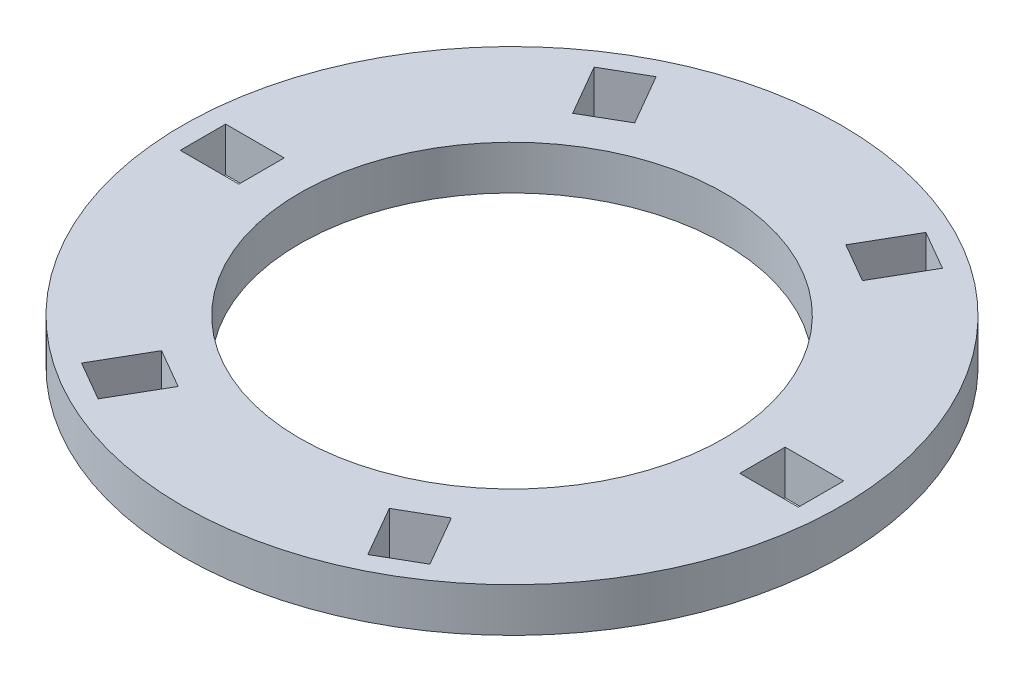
ISO-10303-21;
HEADER;
FILE_DESCRIPTION(('STEP AP214'),'2;1');
FILE_NAME('part.step','',(''),(''),'','','');
FILE_SCHEMA(('AUTOMOTIVE_DESIGN { 1 0 10303 214 1 1 1 1 }'));
ENDSEC;
DATA;
#1=APPLICATION_CONTEXT('core data for automotive mechanical design processes');
#2=APPLICATION_PROTOCOL_DEFINITION('international standard','automotive_design',2000,#1);
#3=PRODUCT_CONTEXT('',#1,'mechanical');
#4=PRODUCT('Part','Part','',(#3));
#5=PRODUCT_RELATED_PRODUCT_CATEGORY('part','',(#4));
#6=PRODUCT_DEFINITION_FORMATION('','',#4);
#7=PRODUCT_DEFINITION_CONTEXT('part definition',#1,'design');
#8=PRODUCT_DEFINITION('design','',#6,#7);
#9=PRODUCT_DEFINITION_SHAPE('','',#8);
#10=(LENGTH_UNIT() NAMED_UNIT(*) SI_UNIT(.MILLI.,.METRE.));
#11=(NAMED_UNIT(*) PLANE_ANGLE_UNIT() SI_UNIT($,.RADIAN.));
#12=(NAMED_UNIT(*) SI_UNIT($,.STERADIAN.) SOLID_ANGLE_UNIT());
#13=UNCERTAINTY_MEASURE_WITH_UNIT(LENGTH_MEASURE(1.E-05),#10,'distance_accuracy_value','');
#14=(GEOMETRIC_REPRESENTATION_CONTEXT(3) GLOBAL_UNCERTAINTY_ASSIGNED_CONTEXT((#13)) GLOBAL_UNIT_ASSIGNED_CONTEXT((#10,
#11,#12)) REPRESENTATION_CONTEXT('',''));
#15=CARTESIAN_POINT('',(0.,0.,0.));
#16=DIRECTION('',(0.,0.,1.));
#17=DIRECTION('',(1.,0.,0.));
#18=AXIS2_PLACEMENT_3D('',#15,#16,#17);
#19=CARTESIAN_POINT('',(0.,6.,0.));
#20=DIRECTION('',(0.,-1.,0.));
#21=DIRECTION('',(0.,0.,-1.));
#22=AXIS2_PLACEMENT_3D('',#19,#20,#21);
#23=CYLINDRICAL_SURFACE('',#22,45.);
#24=CARTESIAN_POINT('',(0.,6.,0.));
#25=DIRECTION('',(0.,1.,0.));
#26=DIRECTION('',(0.,0.,-1.));
#27=AXIS2_PLACEMENT_3D('',#24,#25,#26);
#28=CIRCLE('',#27,45.);
#29=CARTESIAN_POINT('',(0.,6.,-45.));
#30=VERTEX_POINT('',#29);
#31=EDGE_CURVE('E11',#30,#30,#28,.T.);
#32=ORIENTED_EDGE('',*,*,#31,.F.);
#33=EDGE_LOOP('',(#32));
#34=FACE_BOUND('',#33,.T.);
#35=CARTESIAN_POINT('',(0.,0.,0.));
#36=DIRECTION('',(0.,1.,0.));
#37=DIRECTION('',(0.,0.,-1.));
#38=AXIS2_PLACEMENT_3D('',#35,#36,#37);
#39=CIRCLE('',#38,45.);
#40=CARTESIAN_POINT('',(0.,0.,-45.));
#41=VERTEX_POINT('',#40);
#42=EDGE_CURVE('E44',#41,#41,#39,.T.);
#43=ORIENTED_EDGE('',*,*,#42,.T.);
#44=EDGE_LOOP('',(#43));
#45=FACE_BOUND('',#44,.T.);
#46=ADVANCED_FACE('F41',(#34,#45),#23,.T.);
#47=CARTESIAN_POINT('',(0.,6.,0.));
#48=DIRECTION('',(0.,-1.,0.));
#49=DIRECTION('',(0.,0.,-1.));
#50=AXIS2_PLACEMENT_3D('',#47,#48,#49);
#51=PLANE('',#50);
#52=DIRECTION('',(0.50000000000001,0.,0.866025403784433));
#53=VECTOR('',#52,1.);
#54=CARTESIAN_POINT('',(-23.7846787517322,6.,-34.996272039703));
#55=LINE('',#54,#53);
#56=CARTESIAN_POINT('',(-23.7846787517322,6.,-34.996272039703));
#57=VERTEX_POINT('',#56);
#58=CARTESIAN_POINT('',(-19.7846787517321,6.,-28.0680688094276));
#59=VERTEX_POINT('',#58);
#60=EDGE_CURVE('E323',#57,#59,#55,.T.);
#61=ORIENTED_EDGE('',*,*,#60,.F.);
#62=DIRECTION('',(-0.866025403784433,0.,0.50000000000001));
#63=VECTOR('',#62,1.);
#64=CARTESIAN_POINT('',(-18.4153212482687,6.,-38.0962720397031));
#65=LINE('',#64,#63);
#66=CARTESIAN_POINT('',(-18.4153212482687,6.,-38.0962720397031));
#67=VERTEX_POINT('',#66);
#68=EDGE_CURVE('E55',#67,#57,#65,.T.);
#69=ORIENTED_EDGE('',*,*,#68,.F.);
#70=DIRECTION('',(-0.50000000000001,0.,-0.866025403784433));
#71=VECTOR('',#70,1.);
#72=CARTESIAN_POINT('',(-18.4153212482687,6.,-38.0962720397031));
#73=LINE('',#72,#71);
#74=CARTESIAN_POINT('',(-14.4153212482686,6.,-31.1680688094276));
#75=VERTEX_POINT('',#74);
#76=EDGE_CURVE('E312',#75,#67,#73,.T.);
#77=ORIENTED_EDGE('',*,*,#76,.F.);
#78=DIRECTION('',(0.866025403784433,0.,-0.50000000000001));
#79=VECTOR('',#78,1.);
#80=CARTESIAN_POINT('',(-14.4153212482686,6.,-31.1680688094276));
#81=LINE('',#80,#79);
#82=EDGE_CURVE('E326',#59,#75,#81,.T.);
#83=ORIENTED_EDGE('',*,*,#82,.F.);
#84=EDGE_LOOP('',(#61,#69,#77,#83));
#85=FACE_BOUND('',#84,.T.);
#86=DIRECTION('',(-0.499999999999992,0.,0.866025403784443));
#87=VECTOR('',#86,1.);
#88=CARTESIAN_POINT('',(18.4153212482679,6.,-38.0962720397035));
#89=LINE('',#88,#87);
#90=CARTESIAN_POINT('',(18.4153212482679,6.,-38.0962720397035));
#91=VERTEX_POINT('',#90);
#92=CARTESIAN_POINT('',(14.4153212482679,6.,-31.1680688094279));
#93=VERTEX_POINT('',#92);
#94=EDGE_CURVE('E293',#91,#93,#89,.T.);
#95=ORIENTED_EDGE('',*,*,#94,.F.);
#96=DIRECTION('',(-0.866025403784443,0.,-0.499999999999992));
#97=VECTOR('',#96,1.);
#98=CARTESIAN_POINT('',(23.7846787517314,6.,-34.9962720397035));
#99=LINE('',#98,#97);
#100=CARTESIAN_POINT('',(23.7846787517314,6.,-34.9962720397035));
#101=VERTEX_POINT('',#100);
#102=EDGE_CURVE('E63',#101,#91,#99,.T.);
#103=ORIENTED_EDGE('',*,*,#102,.F.);
#104=DIRECTION('',(0.499999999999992,0.,-0.866025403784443));
#105=VECTOR('',#104,1.);
#106=CARTESIAN_POINT('',(23.7846787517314,6.,-34.9962720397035));
#107=LINE('',#106,#105);
#108=CARTESIAN_POINT('',(19.7846787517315,6.,-28.068068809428));
#109=VERTEX_POINT('',#108);
#110=EDGE_CURVE('E282',#109,#101,#107,.T.);
#111=ORIENTED_EDGE('',*,*,#110,.F.);
#112=DIRECTION('',(0.866025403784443,0.,0.499999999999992));
#113=VECTOR('',#112,1.);
#114=CARTESIAN_POINT('',(19.7846787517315,6.,-28.068068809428));
#115=LINE('',#114,#113);
#116=EDGE_CURVE('E297',#93,#109,#115,.T.);
#117=ORIENTED_EDGE('',*,*,#116,.F.);
#118=EDGE_LOOP('',(#95,#103,#111,#117));
#119=FACE_BOUND('',#118,.T.);
#120=DIRECTION('',(-1.,0.,0.));
#121=VECTOR('',#120,1.);
#122=CARTESIAN_POINT('',(42.2,6.,-3.1));
#123=LINE('',#122,#121);
#124=CARTESIAN_POINT('',(42.2,6.,-3.1));
#125=VERTEX_POINT('',#124);
#126=CARTESIAN_POINT('',(34.2,6.,-3.1));
#127=VERTEX_POINT('',#126);
#128=EDGE_CURVE('E262',#125,#127,#123,.T.);
#129=ORIENTED_EDGE('',*,*,#128,.F.);
#130=DIRECTION('',(0.,0.,-1.));
#131=VECTOR('',#130,1.);
#132=CARTESIAN_POINT('',(42.2,6.,3.09999999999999));
#133=LINE('',#132,#131);
#134=CARTESIAN_POINT('',(42.2,6.,3.09999999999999));
#135=VERTEX_POINT('',#134);
#136=EDGE_CURVE('E260',#135,#125,#133,.T.);
#137=ORIENTED_EDGE('',*,*,#136,.F.);
#138=DIRECTION('',(1.,0.,0.));
#139=VECTOR('',#138,1.);
#140=CARTESIAN_POINT('',(42.2,6.,3.09999999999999));
#141=LINE('',#140,#139);
#142=CARTESIAN_POINT('',(34.2,6.,3.1));
#143=VERTEX_POINT('',#142);
#144=EDGE_CURVE('E250',#143,#135,#141,.T.);
#145=ORIENTED_EDGE('',*,*,#144,.F.);
#146=DIRECTION('',(0.,0.,1.));
#147=VECTOR('',#146,1.);
#148=CARTESIAN_POINT('',(34.2,6.,3.1));
#149=LINE('',#148,#147);
#150=EDGE_CURVE('E266',#127,#143,#149,.T.);
#151=ORIENTED_EDGE('',*,*,#150,.F.);
#152=EDGE_LOOP('',(#129,#137,#145,#151));
#153=FACE_BOUND('',#152,.T.);
#154=DIRECTION('',(-0.500000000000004,0.,-0.866025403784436));
#155=VECTOR('',#154,1.);
#156=CARTESIAN_POINT('',(23.7846787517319,6.,34.9962720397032));
#157=LINE('',#156,#155);
#158=CARTESIAN_POINT('',(23.7846787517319,6.,34.9962720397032));
#159=VERTEX_POINT('',#158);
#160=CARTESIAN_POINT('',(19.7846787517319,6.,28.0680688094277));
#161=VERTEX_POINT('',#160);
#162=EDGE_CURVE('E235',#159,#161,#157,.T.);
#163=ORIENTED_EDGE('',*,*,#162,.F.);
#164=DIRECTION('',(0.866025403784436,0.,-0.500000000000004));
#165=VECTOR('',#164,1.);
#166=CARTESIAN_POINT('',(18.4153212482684,6.,38.0962720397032));
#167=LINE('',#166,#165);
#168=CARTESIAN_POINT('',(18.4153212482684,6.,38.0962720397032));
#169=VERTEX_POINT('',#168);
#170=EDGE_CURVE('E208',#169,#159,#167,.T.);
#171=ORIENTED_EDGE('',*,*,#170,.F.);
#172=DIRECTION('',(0.500000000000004,0.,0.866025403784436));
#173=VECTOR('',#172,1.);
#174=CARTESIAN_POINT('',(18.4153212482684,6.,38.0962720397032));
#175=LINE('',#174,#173);
#176=CARTESIAN_POINT('',(14.4153212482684,6.,31.1680688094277));
#177=VERTEX_POINT('',#176);
#178=EDGE_CURVE('E226',#177,#169,#175,.T.);
#179=ORIENTED_EDGE('',*,*,#178,.F.);
#180=DIRECTION('',(-0.866025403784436,0.,0.500000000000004));
#181=VECTOR('',#180,1.);
#182=CARTESIAN_POINT('',(14.4153212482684,6.,31.1680688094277));
#183=LINE('',#182,#181);
#184=EDGE_CURVE('E229',#161,#177,#183,.T.);
#185=ORIENTED_EDGE('',*,*,#184,.F.);
#186=EDGE_LOOP('',(#163,#171,#179,#185));
#187=FACE_BOUND('',#186,.T.);
#188=DIRECTION('',(0.499999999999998,0.,-0.86602540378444));
#189=VECTOR('',#188,1.);
#190=CARTESIAN_POINT('',(-18.4153212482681,6.,38.0962720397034));
#191=LINE('',#190,#189);
#192=CARTESIAN_POINT('',(-18.4153212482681,6.,38.0962720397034));
#193=VERTEX_POINT('',#192);
#194=CARTESIAN_POINT('',(-14.4153212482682,6.,31.1680688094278));
#195=VERTEX_POINT('',#194);
#196=EDGE_CURVE('E352',#193,#195,#191,.T.);
#197=ORIENTED_EDGE('',*,*,#196,.F.);
#198=DIRECTION('',(0.86602540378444,0.,0.499999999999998));
#199=VECTOR('',#198,1.);
#200=CARTESIAN_POINT('',(-23.7846787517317,6.,34.9962720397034));
#201=LINE('',#200,#199);
#202=CARTESIAN_POINT('',(-23.7846787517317,6.,34.9962720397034));
#203=VERTEX_POINT('',#202);
#204=EDGE_CURVE('E242',#203,#193,#201,.T.);
#205=ORIENTED_EDGE('',*,*,#204,.F.);
#206=DIRECTION('',(-0.499999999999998,0.,0.86602540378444));
#207=VECTOR('',#206,1.);
#208=CARTESIAN_POINT('',(-23.7846787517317,6.,34.9962720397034));
#209=LINE('',#208,#207);
#210=CARTESIAN_POINT('',(-19.7846787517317,6.,28.0680688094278));
#211=VERTEX_POINT('',#210);
#212=EDGE_CURVE('E341',#211,#203,#209,.T.);
#213=ORIENTED_EDGE('',*,*,#212,.F.);
#214=DIRECTION('',(-0.86602540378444,0.,-0.499999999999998));
#215=VECTOR('',#214,1.);
#216=CARTESIAN_POINT('',(-19.7846787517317,6.,28.0680688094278));
#217=LINE('',#216,#215);
#218=EDGE_CURVE('E355',#195,#211,#217,.T.);
#219=ORIENTED_EDGE('',*,*,#218,.F.);
#220=EDGE_LOOP('',(#197,#205,#213,#219));
#221=FACE_BOUND('',#220,.T.);
#222=DIRECTION('',(1.,0.,0.));
#223=VECTOR('',#222,1.);
#224=CARTESIAN_POINT('',(-42.2,6.,3.1));
#225=LINE('',#224,#223);
#226=CARTESIAN_POINT('',(-42.2,6.,3.1));
#227=VERTEX_POINT('',#226);
#228=CARTESIAN_POINT('',(-34.2,6.,3.1));
#229=VERTEX_POINT('',#228);
#230=EDGE_CURVE('E384',#227,#229,#225,.T.);
#231=ORIENTED_EDGE('',*,*,#230,.F.);
#232=DIRECTION('',(0.,0.,1.));
#233=VECTOR('',#232,1.);
#234=CARTESIAN_POINT('',(-42.2,6.,-3.09999999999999));
#235=LINE('',#234,#233);
#236=CARTESIAN_POINT('',(-42.2,6.,-3.09999999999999));
#237=VERTEX_POINT('',#236);
#238=EDGE_CURVE('E362',#237,#227,#235,.T.);
#239=ORIENTED_EDGE('',*,*,#238,.F.);
#240=DIRECTION('',(-1.,0.,0.));
#241=VECTOR('',#240,1.);
#242=CARTESIAN_POINT('',(-42.2,6.,-3.09999999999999));
#243=LINE('',#242,#241);
#244=CARTESIAN_POINT('',(-34.2,6.,-3.1));
#245=VERTEX_POINT('',#244);
#246=EDGE_CURVE('E373',#245,#237,#243,.T.);
#247=ORIENTED_EDGE('',*,*,#246,.F.);
#248=DIRECTION('',(0.,0.,-1.));
#249=VECTOR('',#248,1.);
#250=CARTESIAN_POINT('',(-34.2,6.,-3.1));
#251=LINE('',#250,#249);
#252=EDGE_CURVE('E387',#229,#245,#251,.T.);
#253=ORIENTED_EDGE('',*,*,#252,.F.);
#254=EDGE_LOOP('',(#231,#239,#247,#253));
#255=FACE_BOUND('',#254,.T.);
#256=CARTESIAN_POINT('',(0.,6.,0.));
#257=DIRECTION('',(0.,1.,0.));
#258=DIRECTION('',(0.,0.,1.));
#259=AXIS2_PLACEMENT_3D('',#256,#257,#258);
#260=CIRCLE('',#259,29.);
#261=CARTESIAN_POINT('',(0.,6.,29.));
#262=VERTEX_POINT('',#261);
#263=EDGE_CURVE('E394',#262,#262,#260,.T.);
#264=ORIENTED_EDGE('',*,*,#263,.F.);
#265=EDGE_LOOP('',(#264));
#266=FACE_BOUND('',#265,.T.);
#267=ORIENTED_EDGE('',*,*,#31,.T.);
#268=EDGE_LOOP('',(#267));
#269=FACE_BOUND('',#268,.T.);
#270=ADVANCED_FACE('F409',(#85,#119,#153,#187,#221,#255,#266,#269),#51,.F.);
#271=CARTESIAN_POINT('',(0.,0.,0.));
#272=DIRECTION('',(0.,-1.,0.));
#273=DIRECTION('',(0.,0.,-1.));
#274=AXIS2_PLACEMENT_3D('',#271,#272,#273);
#275=PLANE('',#274);
#276=DIRECTION('',(-0.866025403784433,0.,0.50000000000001));
#277=VECTOR('',#276,1.);
#278=CARTESIAN_POINT('',(-18.4153212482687,0.,-38.0962720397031));
#279=LINE('',#278,#277);
#280=CARTESIAN_POINT('',(-18.4153212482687,0.,-38.0962720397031));
#281=VERTEX_POINT('',#280);
#282=CARTESIAN_POINT('',(-23.7846787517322,0.,-34.996272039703));
#283=VERTEX_POINT('',#282);
#284=EDGE_CURVE('E308',#281,#283,#279,.T.);
#285=ORIENTED_EDGE('',*,*,#284,.T.);
#286=DIRECTION('',(0.50000000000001,0.,0.866025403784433));
#287=VECTOR('',#286,1.);
#288=CARTESIAN_POINT('',(-23.7846787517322,0.,-34.996272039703));
#289=LINE('',#288,#287);
#290=CARTESIAN_POINT('',(-19.7846787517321,0.,-28.0680688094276));
#291=VERTEX_POINT('',#290);
#292=EDGE_CURVE('E311',#283,#291,#289,.T.);
#293=ORIENTED_EDGE('',*,*,#292,.T.);
#294=DIRECTION('',(0.866025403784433,0.,-0.50000000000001));
#295=VECTOR('',#294,1.);
#296=CARTESIAN_POINT('',(-14.4153212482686,0.,-31.1680688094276));
#297=LINE('',#296,#295);
#298=CARTESIAN_POINT('',(-14.4153212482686,0.,-31.1680688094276));
#299=VERTEX_POINT('',#298);
#300=EDGE_CURVE('E315',#291,#299,#297,.T.);
#301=ORIENTED_EDGE('',*,*,#300,.T.);
#302=DIRECTION('',(-0.50000000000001,0.,-0.866025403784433));
#303=VECTOR('',#302,1.);
#304=CARTESIAN_POINT('',(-18.4153212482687,0.,-38.0962720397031));
#305=LINE('',#304,#303);
#306=EDGE_CURVE('E318',#299,#281,#305,.T.);
#307=ORIENTED_EDGE('',*,*,#306,.T.);
#308=EDGE_LOOP('',(#285,#293,#301,#307));
#309=FACE_BOUND('',#308,.T.);
#310=DIRECTION('',(-0.866025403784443,0.,-0.499999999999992));
#311=VECTOR('',#310,1.);
#312=CARTESIAN_POINT('',(23.7846787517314,0.,-34.9962720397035));
#313=LINE('',#312,#311);
#314=CARTESIAN_POINT('',(23.7846787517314,0.,-34.9962720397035));
#315=VERTEX_POINT('',#314);
#316=CARTESIAN_POINT('',(18.4153212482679,0.,-38.0962720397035));
#317=VERTEX_POINT('',#316);
#318=EDGE_CURVE('E278',#315,#317,#313,.T.);
#319=ORIENTED_EDGE('',*,*,#318,.T.);
#320=DIRECTION('',(-0.499999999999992,0.,0.866025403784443));
#321=VECTOR('',#320,1.);
#322=CARTESIAN_POINT('',(18.4153212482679,0.,-38.0962720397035));
#323=LINE('',#322,#321);
#324=CARTESIAN_POINT('',(14.4153212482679,0.,-31.1680688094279));
#325=VERTEX_POINT('',#324);
#326=EDGE_CURVE('E281',#317,#325,#323,.T.);
#327=ORIENTED_EDGE('',*,*,#326,.T.);
#328=DIRECTION('',(0.866025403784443,0.,0.499999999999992));
#329=VECTOR('',#328,1.);
#330=CARTESIAN_POINT('',(19.7846787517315,0.,-28.068068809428));
#331=LINE('',#330,#329);
#332=CARTESIAN_POINT('',(19.7846787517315,0.,-28.068068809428));
#333=VERTEX_POINT('',#332);
#334=EDGE_CURVE('E285',#325,#333,#331,.T.);
#335=ORIENTED_EDGE('',*,*,#334,.T.);
#336=DIRECTION('',(0.499999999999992,0.,-0.866025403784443));
#337=VECTOR('',#336,1.);
#338=CARTESIAN_POINT('',(23.7846787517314,0.,-34.9962720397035));
#339=LINE('',#338,#337);
#340=EDGE_CURVE('E288',#333,#315,#339,.T.);
#341=ORIENTED_EDGE('',*,*,#340,.T.);
#342=EDGE_LOOP('',(#319,#327,#335,#341));
#343=FACE_BOUND('',#342,.T.);
#344=DIRECTION('',(0.,0.,-1.));
#345=VECTOR('',#344,1.);
#346=CARTESIAN_POINT('',(42.2,0.,3.09999999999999));
#347=LINE('',#346,#345);
#348=CARTESIAN_POINT('',(42.2,0.,3.09999999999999));
#349=VERTEX_POINT('',#348);
#350=CARTESIAN_POINT('',(42.2,0.,-3.1));
#351=VERTEX_POINT('',#350);
#352=EDGE_CURVE('E246',#349,#351,#347,.T.);
#353=ORIENTED_EDGE('',*,*,#352,.T.);
#354=DIRECTION('',(-1.,0.,0.));
#355=VECTOR('',#354,1.);
#356=CARTESIAN_POINT('',(42.2,0.,-3.1));
#357=LINE('',#356,#355);
#358=CARTESIAN_POINT('',(34.2,0.,-3.1));
#359=VERTEX_POINT('',#358);
#360=EDGE_CURVE('E249',#351,#359,#357,.T.);
#361=ORIENTED_EDGE('',*,*,#360,.T.);
#362=DIRECTION('',(0.,0.,1.));
#363=VECTOR('',#362,1.);
#364=CARTESIAN_POINT('',(34.2,0.,3.1));
#365=LINE('',#364,#363);
#366=CARTESIAN_POINT('',(34.2,0.,3.1));
#367=VERTEX_POINT('',#366);
#368=EDGE_CURVE('E253',#359,#367,#365,.T.);
#369=ORIENTED_EDGE('',*,*,#368,.T.);
#370=DIRECTION('',(1.,0.,0.));
#371=VECTOR('',#370,1.);
#372=CARTESIAN_POINT('',(42.2,0.,3.09999999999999));
#373=LINE('',#372,#371);
#374=EDGE_CURVE('E256',#367,#349,#373,.T.);
#375=ORIENTED_EDGE('',*,*,#374,.T.);
#376=EDGE_LOOP('',(#353,#361,#369,#375));
#377=FACE_BOUND('',#376,.T.);
#378=DIRECTION('',(0.866025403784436,0.,-0.500000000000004));
#379=VECTOR('',#378,1.);
#380=CARTESIAN_POINT('',(18.4153212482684,0.,38.0962720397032));
#381=LINE('',#380,#379);
#382=CARTESIAN_POINT('',(18.4153212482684,0.,38.0962720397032));
#383=VERTEX_POINT('',#382);
#384=CARTESIAN_POINT('',(23.7846787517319,0.,34.9962720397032));
#385=VERTEX_POINT('',#384);
#386=EDGE_CURVE('E205',#383,#385,#381,.T.);
#387=ORIENTED_EDGE('',*,*,#386,.T.);
#388=DIRECTION('',(-0.500000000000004,0.,-0.866025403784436));
#389=VECTOR('',#388,1.);
#390=CARTESIAN_POINT('',(23.7846787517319,0.,34.9962720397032));
#391=LINE('',#390,#389);
#392=CARTESIAN_POINT('',(19.7846787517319,0.,28.0680688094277));
#393=VERTEX_POINT('',#392);
#394=EDGE_CURVE('E217',#385,#393,#391,.T.);
#395=ORIENTED_EDGE('',*,*,#394,.T.);
#396=DIRECTION('',(-0.866025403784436,0.,0.500000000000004));
#397=VECTOR('',#396,1.);
#398=CARTESIAN_POINT('',(14.4153212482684,0.,31.1680688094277));
#399=LINE('',#398,#397);
#400=CARTESIAN_POINT('',(14.4153212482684,0.,31.1680688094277));
#401=VERTEX_POINT('',#400);
#402=EDGE_CURVE('E221',#393,#401,#399,.T.);
#403=ORIENTED_EDGE('',*,*,#402,.T.);
#404=DIRECTION('',(0.500000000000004,0.,0.866025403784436));
#405=VECTOR('',#404,1.);
#406=CARTESIAN_POINT('',(18.4153212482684,0.,38.0962720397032));
#407=LINE('',#406,#405);
#408=EDGE_CURVE('E213',#401,#383,#407,.T.);
#409=ORIENTED_EDGE('',*,*,#408,.T.);
#410=EDGE_LOOP('',(#387,#395,#403,#409));
#411=FACE_BOUND('',#410,.T.);
#412=DIRECTION('',(0.86602540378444,0.,0.499999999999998));
#413=VECTOR('',#412,1.);
#414=CARTESIAN_POINT('',(-23.7846787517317,0.,34.9962720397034));
#415=LINE('',#414,#413);
#416=CARTESIAN_POINT('',(-23.7846787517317,0.,34.9962720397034));
#417=VERTEX_POINT('',#416);
#418=CARTESIAN_POINT('',(-18.4153212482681,0.,38.0962720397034));
#419=VERTEX_POINT('',#418);
#420=EDGE_CURVE('E337',#417,#419,#415,.T.);
#421=ORIENTED_EDGE('',*,*,#420,.T.);
#422=DIRECTION('',(0.499999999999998,0.,-0.86602540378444));
#423=VECTOR('',#422,1.);
#424=CARTESIAN_POINT('',(-18.4153212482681,0.,38.0962720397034));
#425=LINE('',#424,#423);
#426=CARTESIAN_POINT('',(-14.4153212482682,0.,31.1680688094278));
#427=VERTEX_POINT('',#426);
#428=EDGE_CURVE('E340',#419,#427,#425,.T.);
#429=ORIENTED_EDGE('',*,*,#428,.T.);
#430=DIRECTION('',(-0.86602540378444,0.,-0.499999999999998));
#431=VECTOR('',#430,1.);
#432=CARTESIAN_POINT('',(-19.7846787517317,0.,28.0680688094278));
#433=LINE('',#432,#431);
#434=CARTESIAN_POINT('',(-19.7846787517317,0.,28.0680688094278));
#435=VERTEX_POINT('',#434);
#436=EDGE_CURVE('E344',#427,#435,#433,.T.);
#437=ORIENTED_EDGE('',*,*,#436,.T.);
#438=DIRECTION('',(-0.499999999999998,0.,0.86602540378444));
#439=VECTOR('',#438,1.);
#440=CARTESIAN_POINT('',(-23.7846787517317,0.,34.9962720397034));
#441=LINE('',#440,#439);
#442=EDGE_CURVE('E347',#435,#417,#441,.T.);
#443=ORIENTED_EDGE('',*,*,#442,.T.);
#444=EDGE_LOOP('',(#421,#429,#437,#443));
#445=FACE_BOUND('',#444,.T.);
#446=DIRECTION('',(0.,0.,1.));
#447=VECTOR('',#446,1.);
#448=CARTESIAN_POINT('',(-42.2,0.,-3.09999999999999));
#449=LINE('',#448,#447);
#450=CARTESIAN_POINT('',(-42.2,0.,-3.09999999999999));
#451=VERTEX_POINT('',#450);
#452=CARTESIAN_POINT('',(-42.2,0.,3.1));
#453=VERTEX_POINT('',#452);
#454=EDGE_CURVE('E369',#451,#453,#449,.T.);
#455=ORIENTED_EDGE('',*,*,#454,.T.);
#456=DIRECTION('',(1.,0.,0.));
#457=VECTOR('',#456,1.);
#458=CARTESIAN_POINT('',(-42.2,0.,3.1));
#459=LINE('',#458,#457);
#460=CARTESIAN_POINT('',(-34.2,0.,3.1));
#461=VERTEX_POINT('',#460);
#462=EDGE_CURVE('E372',#453,#461,#459,.T.);
#463=ORIENTED_EDGE('',*,*,#462,.T.);
#464=DIRECTION('',(0.,0.,-1.));
#465=VECTOR('',#464,1.);
#466=CARTESIAN_POINT('',(-34.2,0.,-3.1));
#467=LINE('',#466,#465);
#468=CARTESIAN_POINT('',(-34.2,0.,-3.1));
#469=VERTEX_POINT('',#468);
#470=EDGE_CURVE('E376',#461,#469,#467,.T.);
#471=ORIENTED_EDGE('',*,*,#470,.T.);
#472=DIRECTION('',(-1.,0.,0.));
#473=VECTOR('',#472,1.);
#474=CARTESIAN_POINT('',(-42.2,0.,-3.09999999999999));
#475=LINE('',#474,#473);
#476=EDGE_CURVE('E379',#469,#451,#475,.T.);
#477=ORIENTED_EDGE('',*,*,#476,.T.);
#478=EDGE_LOOP('',(#455,#463,#471,#477));
#479=FACE_BOUND('',#478,.T.);
#480=CARTESIAN_POINT('',(0.,0.,0.));
#481=DIRECTION('',(0.,1.,0.));
#482=DIRECTION('',(0.,0.,1.));
#483=AXIS2_PLACEMENT_3D('',#480,#481,#482);
#484=CIRCLE('',#483,29.);
#485=CARTESIAN_POINT('',(0.,0.,29.));
#486=VERTEX_POINT('',#485);
#487=EDGE_CURVE('E401',#486,#486,#484,.T.);
#488=ORIENTED_EDGE('',*,*,#487,.T.);
#489=EDGE_LOOP('',(#488));
#490=FACE_BOUND('',#489,.T.);
#491=ORIENTED_EDGE('',*,*,#42,.F.);
#492=EDGE_LOOP('',(#491));
#493=FACE_BOUND('',#492,.T.);
#494=ADVANCED_FACE('F223',(#309,#343,#377,#411,#445,#479,#490,#493),#275,.T.);
#495=CARTESIAN_POINT('',(0.,0.,0.));
#496=DIRECTION('',(0.,1.,0.));
#497=DIRECTION('',(0.,0.,1.));
#498=AXIS2_PLACEMENT_3D('',#495,#496,#497);
#499=CYLINDRICAL_SURFACE('',#498,29.);
#500=ORIENTED_EDGE('',*,*,#487,.F.);
#501=EDGE_LOOP('',(#500));
#502=FACE_BOUND('',#501,.T.);
#503=ORIENTED_EDGE('',*,*,#263,.T.);
#504=EDGE_LOOP('',(#503));
#505=FACE_BOUND('',#504,.T.);
#506=ADVANCED_FACE('F407',(#502,#505),#499,.F.);
#507=CARTESIAN_POINT('',(-42.2,0.,-3.09999999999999));
#508=DIRECTION('',(-1.,0.,0.));
#509=DIRECTION('',(0.,0.,1.));
#510=AXIS2_PLACEMENT_3D('',#507,#508,#509);
#511=PLANE('',#510);
#512=ORIENTED_EDGE('',*,*,#238,.T.);
#513=DIRECTION('',(0.,1.,0.));
#514=VECTOR('',#513,1.);
#515=CARTESIAN_POINT('',(-42.2,0.,3.1));
#516=LINE('',#515,#514);
#517=EDGE_CURVE('E382',#453,#227,#516,.T.);
#518=ORIENTED_EDGE('',*,*,#517,.F.);
#519=ORIENTED_EDGE('',*,*,#454,.F.);
#520=DIRECTION('',(0.,1.,0.));
#521=VECTOR('',#520,1.);
#522=CARTESIAN_POINT('',(-42.2,0.,-3.09999999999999));
#523=LINE('',#522,#521);
#524=EDGE_CURVE('E392',#451,#237,#523,.T.);
#525=ORIENTED_EDGE('',*,*,#524,.T.);
#526=EDGE_LOOP('',(#512,#518,#519,#525));
#527=FACE_BOUND('',#526,.T.);
#528=ADVANCED_FACE('F427',(#527),#511,.F.);
#529=CARTESIAN_POINT('',(-42.2,0.,-3.09999999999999));
#530=DIRECTION('',(0.,0.,-1.));
#531=DIRECTION('',(-1.,0.,0.));
#532=AXIS2_PLACEMENT_3D('',#529,#530,#531);
#533=PLANE('',#532);
#534=ORIENTED_EDGE('',*,*,#246,.T.);
#535=ORIENTED_EDGE('',*,*,#524,.F.);
#536=ORIENTED_EDGE('',*,*,#476,.F.);
#537=DIRECTION('',(0.,1.,0.));
#538=VECTOR('',#537,1.);
#539=CARTESIAN_POINT('',(-34.2,0.,-3.1));
#540=LINE('',#539,#538);
#541=EDGE_CURVE('E395',#469,#245,#540,.T.);
#542=ORIENTED_EDGE('',*,*,#541,.T.);
#543=EDGE_LOOP('',(#534,#535,#536,#542));
#544=FACE_BOUND('',#543,.T.);
#545=ADVANCED_FACE('F434',(#544),#533,.F.);
#546=CARTESIAN_POINT('',(-34.2,0.,-3.1));
#547=DIRECTION('',(1.,0.,0.));
#548=DIRECTION('',(0.,0.,-1.));
#549=AXIS2_PLACEMENT_3D('',#546,#547,#548);
#550=PLANE('',#549);
#551=ORIENTED_EDGE('',*,*,#252,.T.);
#552=ORIENTED_EDGE('',*,*,#541,.F.);
#553=ORIENTED_EDGE('',*,*,#470,.F.);
#554=DIRECTION('',(0.,1.,0.));
#555=VECTOR('',#554,1.);
#556=CARTESIAN_POINT('',(-34.2,0.,3.1));
#557=LINE('',#556,#555);
#558=EDGE_CURVE('E397',#461,#229,#557,.T.);
#559=ORIENTED_EDGE('',*,*,#558,.T.);
#560=EDGE_LOOP('',(#551,#552,#553,#559));
#561=FACE_BOUND('',#560,.T.);
#562=ADVANCED_FACE('F440',(#561),#550,.F.);
#563=CARTESIAN_POINT('',(-42.2,0.,3.1));
#564=DIRECTION('',(0.,0.,1.));
#565=DIRECTION('',(1.,0.,0.));
#566=AXIS2_PLACEMENT_3D('',#563,#564,#565);
#567=PLANE('',#566);
#568=ORIENTED_EDGE('',*,*,#230,.T.);
#569=ORIENTED_EDGE('',*,*,#558,.F.);
#570=ORIENTED_EDGE('',*,*,#462,.F.);
#571=ORIENTED_EDGE('',*,*,#517,.T.);
#572=EDGE_LOOP('',(#568,#569,#570,#571));
#573=FACE_BOUND('',#572,.T.);
#574=ADVANCED_FACE('F436',(#573),#567,.F.);
#575=CARTESIAN_POINT('',(-23.7846787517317,0.,34.9962720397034));
#576=DIRECTION('',(-0.499999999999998,0.,0.86602540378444));
#577=DIRECTION('',(0.86602540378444,0.,0.499999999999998));
#578=AXIS2_PLACEMENT_3D('',#575,#576,#577);
#579=PLANE('',#578);
#580=ORIENTED_EDGE('',*,*,#204,.T.);
#581=DIRECTION('',(0.,1.,0.));
#582=VECTOR('',#581,1.);
#583=CARTESIAN_POINT('',(-18.4153212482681,0.,38.0962720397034));
#584=LINE('',#583,#582);
#585=EDGE_CURVE('E350',#419,#193,#584,.T.);
#586=ORIENTED_EDGE('',*,*,#585,.F.);
#587=ORIENTED_EDGE('',*,*,#420,.F.);
#588=DIRECTION('',(0.,1.,0.));
#589=VECTOR('',#588,1.);
#590=CARTESIAN_POINT('',(-23.7846787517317,0.,34.9962720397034));
#591=LINE('',#590,#589);
#592=EDGE_CURVE('E360',#417,#203,#591,.T.);
#593=ORIENTED_EDGE('',*,*,#592,.T.);
#594=EDGE_LOOP('',(#580,#586,#587,#593));
#595=FACE_BOUND('',#594,.T.);
#596=ADVANCED_FACE('F439',(#595),#579,.F.);
#597=CARTESIAN_POINT('',(-23.7846787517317,0.,34.9962720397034));
#598=DIRECTION('',(-0.86602540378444,0.,-0.499999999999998));
#599=DIRECTION('',(-0.499999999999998,0.,0.86602540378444));
#600=AXIS2_PLACEMENT_3D('',#597,#598,#599);
#601=PLANE('',#600);
#602=ORIENTED_EDGE('',*,*,#212,.T.);
#603=ORIENTED_EDGE('',*,*,#592,.F.);
#604=ORIENTED_EDGE('',*,*,#442,.F.);
#605=DIRECTION('',(0.,1.,0.));
#606=VECTOR('',#605,1.);
#607=CARTESIAN_POINT('',(-19.7846787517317,0.,28.0680688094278));
#608=LINE('',#607,#606);
#609=EDGE_CURVE('E363',#435,#211,#608,.T.);
#610=ORIENTED_EDGE('',*,*,#609,.T.);
#611=EDGE_LOOP('',(#602,#603,#604,#610));
#612=FACE_BOUND('',#611,.T.);
#613=ADVANCED_FACE('F449',(#612),#601,.F.);
#614=CARTESIAN_POINT('',(-19.7846787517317,0.,28.0680688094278));
#615=DIRECTION('',(0.499999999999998,0.,-0.86602540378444));
#616=DIRECTION('',(-0.86602540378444,0.,-0.499999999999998));
#617=AXIS2_PLACEMENT_3D('',#614,#615,#616);
#618=PLANE('',#617);
#619=ORIENTED_EDGE('',*,*,#218,.T.);
#620=ORIENTED_EDGE('',*,*,#609,.F.);
#621=ORIENTED_EDGE('',*,*,#436,.F.);
#622=DIRECTION('',(0.,1.,0.));
#623=VECTOR('',#622,1.);
#624=CARTESIAN_POINT('',(-14.4153212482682,0.,31.1680688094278));
#625=LINE('',#624,#623);
#626=EDGE_CURVE('E365',#427,#195,#625,.T.);
#627=ORIENTED_EDGE('',*,*,#626,.T.);
#628=EDGE_LOOP('',(#619,#620,#621,#627));
#629=FACE_BOUND('',#628,.T.);
#630=ADVANCED_FACE('F454',(#629),#618,.F.);
#631=CARTESIAN_POINT('',(-18.4153212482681,0.,38.0962720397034));
#632=DIRECTION('',(0.86602540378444,0.,0.499999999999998));
#633=DIRECTION('',(0.499999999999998,0.,-0.86602540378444));
#634=AXIS2_PLACEMENT_3D('',#631,#632,#633);
#635=PLANE('',#634);
#636=ORIENTED_EDGE('',*,*,#196,.T.);
#637=ORIENTED_EDGE('',*,*,#626,.F.);
#638=ORIENTED_EDGE('',*,*,#428,.F.);
#639=ORIENTED_EDGE('',*,*,#585,.T.);
#640=EDGE_LOOP('',(#636,#637,#638,#639));
#641=FACE_BOUND('',#640,.T.);
#642=ADVANCED_FACE('F451',(#641),#635,.F.);
#643=CARTESIAN_POINT('',(18.4153212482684,0.,38.0962720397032));
#644=DIRECTION('',(0.500000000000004,0.,0.866025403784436));
#645=DIRECTION('',(0.866025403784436,0.,-0.500000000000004));
#646=AXIS2_PLACEMENT_3D('',#643,#644,#645);
#647=PLANE('',#646);
#648=ORIENTED_EDGE('',*,*,#170,.T.);
#649=DIRECTION('',(0.,1.,0.));
#650=VECTOR('',#649,1.);
#651=CARTESIAN_POINT('',(23.7846787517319,0.,34.9962720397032));
#652=LINE('',#651,#650);
#653=EDGE_CURVE('E201',#385,#159,#652,.T.);
#654=ORIENTED_EDGE('',*,*,#653,.F.);
#655=ORIENTED_EDGE('',*,*,#386,.F.);
#656=DIRECTION('',(0.,1.,0.));
#657=VECTOR('',#656,1.);
#658=CARTESIAN_POINT('',(18.4153212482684,0.,38.0962720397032));
#659=LINE('',#658,#657);
#660=EDGE_CURVE('E240',#383,#169,#659,.T.);
#661=ORIENTED_EDGE('',*,*,#660,.T.);
#662=EDGE_LOOP('',(#648,#654,#655,#661));
#663=FACE_BOUND('',#662,.T.);
#664=ADVANCED_FACE('F203',(#663),#647,.F.);
#665=CARTESIAN_POINT('',(18.4153212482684,0.,38.0962720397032));
#666=DIRECTION('',(-0.866025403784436,0.,0.500000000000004));
#667=DIRECTION('',(0.500000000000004,0.,0.866025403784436));
#668=AXIS2_PLACEMENT_3D('',#665,#666,#667);
#669=PLANE('',#668);
#670=ORIENTED_EDGE('',*,*,#178,.T.);
#671=ORIENTED_EDGE('',*,*,#660,.F.);
#672=ORIENTED_EDGE('',*,*,#408,.F.);
#673=DIRECTION('',(0.,1.,0.));
#674=VECTOR('',#673,1.);
#675=CARTESIAN_POINT('',(14.4153212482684,0.,31.1680688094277));
#676=LINE('',#675,#674);
#677=EDGE_CURVE('E243',#401,#177,#676,.T.);
#678=ORIENTED_EDGE('',*,*,#677,.T.);
#679=EDGE_LOOP('',(#670,#671,#672,#678));
#680=FACE_BOUND('',#679,.T.);
#681=ADVANCED_FACE('F510',(#680),#669,.F.);
#682=CARTESIAN_POINT('',(14.4153212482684,0.,31.1680688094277));
#683=DIRECTION('',(-0.500000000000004,0.,-0.866025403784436));
#684=DIRECTION('',(-0.866025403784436,0.,0.500000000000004));
#685=AXIS2_PLACEMENT_3D('',#682,#683,#684);
#686=PLANE('',#685);
#687=ORIENTED_EDGE('',*,*,#184,.T.);
#688=ORIENTED_EDGE('',*,*,#677,.F.);
#689=ORIENTED_EDGE('',*,*,#402,.F.);
#690=DIRECTION('',(0.,1.,0.));
#691=VECTOR('',#690,1.);
#692=CARTESIAN_POINT('',(19.7846787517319,0.,28.0680688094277));
#693=LINE('',#692,#691);
#694=EDGE_CURVE('E212',#393,#161,#693,.T.);
#695=ORIENTED_EDGE('',*,*,#694,.T.);
#696=EDGE_LOOP('',(#687,#688,#689,#695));
#697=FACE_BOUND('',#696,.T.);
#698=ADVANCED_FACE('F513',(#697),#686,.F.);
#699=CARTESIAN_POINT('',(23.7846787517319,0.,34.9962720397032));
#700=DIRECTION('',(0.866025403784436,0.,-0.500000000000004));
#701=DIRECTION('',(-0.500000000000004,0.,-0.866025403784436));
#702=AXIS2_PLACEMENT_3D('',#699,#700,#701);
#703=PLANE('',#702);
#704=ORIENTED_EDGE('',*,*,#162,.T.);
#705=ORIENTED_EDGE('',*,*,#694,.F.);
#706=ORIENTED_EDGE('',*,*,#394,.F.);
#707=ORIENTED_EDGE('',*,*,#653,.T.);
#708=EDGE_LOOP('',(#704,#705,#706,#707));
#709=FACE_BOUND('',#708,.T.);
#710=ADVANCED_FACE('F218',(#709),#703,.F.);
#711=CARTESIAN_POINT('',(42.2,0.,3.09999999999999));
#712=DIRECTION('',(1.,0.,0.));
#713=DIRECTION('',(0.,0.,-1.));
#714=AXIS2_PLACEMENT_3D('',#711,#712,#713);
#715=PLANE('',#714);
#716=ORIENTED_EDGE('',*,*,#136,.T.);
#717=DIRECTION('',(0.,1.,0.));
#718=VECTOR('',#717,1.);
#719=CARTESIAN_POINT('',(42.2,0.,-3.1));
#720=LINE('',#719,#718);
#721=EDGE_CURVE('E259',#351,#125,#720,.T.);
#722=ORIENTED_EDGE('',*,*,#721,.F.);
#723=ORIENTED_EDGE('',*,*,#352,.F.);
#724=DIRECTION('',(0.,1.,0.));
#725=VECTOR('',#724,1.);
#726=CARTESIAN_POINT('',(42.2,0.,3.09999999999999));
#727=LINE('',#726,#725);
#728=EDGE_CURVE('E236',#349,#135,#727,.T.);
#729=ORIENTED_EDGE('',*,*,#728,.T.);
#730=EDGE_LOOP('',(#716,#722,#723,#729));
#731=FACE_BOUND('',#730,.T.);
#732=ADVANCED_FACE('F493',(#731),#715,.F.);
#733=CARTESIAN_POINT('',(42.2,0.,3.09999999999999));
#734=DIRECTION('',(0.,0.,1.));
#735=DIRECTION('',(1.,0.,0.));
#736=AXIS2_PLACEMENT_3D('',#733,#734,#735);
#737=PLANE('',#736);
#738=ORIENTED_EDGE('',*,*,#144,.T.);
#739=ORIENTED_EDGE('',*,*,#728,.F.);
#740=ORIENTED_EDGE('',*,*,#374,.F.);
#741=DIRECTION('',(0.,1.,0.));
#742=VECTOR('',#741,1.);
#743=CARTESIAN_POINT('',(34.2,0.,3.1));
#744=LINE('',#743,#742);
#745=EDGE_CURVE('E272',#367,#143,#744,.T.);
#746=ORIENTED_EDGE('',*,*,#745,.T.);
#747=EDGE_LOOP('',(#738,#739,#740,#746));
#748=FACE_BOUND('',#747,.T.);
#749=ADVANCED_FACE('F496',(#748),#737,.F.);
#750=CARTESIAN_POINT('',(34.2,0.,3.1));
#751=DIRECTION('',(-1.,0.,0.));
#752=DIRECTION('',(0.,0.,1.));
#753=AXIS2_PLACEMENT_3D('',#750,#751,#752);
#754=PLANE('',#753);
#755=ORIENTED_EDGE('',*,*,#150,.T.);
#756=ORIENTED_EDGE('',*,*,#745,.F.);
#757=ORIENTED_EDGE('',*,*,#368,.F.);
#758=DIRECTION('',(0.,1.,0.));
#759=VECTOR('',#758,1.);
#760=CARTESIAN_POINT('',(34.2,0.,-3.1));
#761=LINE('',#760,#759);
#762=EDGE_CURVE('E274',#359,#127,#761,.T.);
#763=ORIENTED_EDGE('',*,*,#762,.T.);
#764=EDGE_LOOP('',(#755,#756,#757,#763));
#765=FACE_BOUND('',#764,.T.);
#766=ADVANCED_FACE('F500',(#765),#754,.F.);
#767=CARTESIAN_POINT('',(42.2,0.,-3.1));
#768=DIRECTION('',(0.,0.,-1.));
#769=DIRECTION('',(-1.,0.,0.));
#770=AXIS2_PLACEMENT_3D('',#767,#768,#769);
#771=PLANE('',#770);
#772=ORIENTED_EDGE('',*,*,#128,.T.);
#773=ORIENTED_EDGE('',*,*,#762,.F.);
#774=ORIENTED_EDGE('',*,*,#360,.F.);
#775=ORIENTED_EDGE('',*,*,#721,.T.);
#776=EDGE_LOOP('',(#772,#773,#774,#775));
#777=FACE_BOUND('',#776,.T.);
#778=ADVANCED_FACE('F482',(#777),#771,.F.);
#779=CARTESIAN_POINT('',(23.7846787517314,0.,-34.9962720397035));
#780=DIRECTION('',(0.499999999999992,0.,-0.866025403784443));
#781=DIRECTION('',(-0.866025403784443,0.,-0.499999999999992));
#782=AXIS2_PLACEMENT_3D('',#779,#780,#781);
#783=PLANE('',#782);
#784=ORIENTED_EDGE('',*,*,#102,.T.);
#785=DIRECTION('',(0.,1.,0.));
#786=VECTOR('',#785,1.);
#787=CARTESIAN_POINT('',(18.4153212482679,0.,-38.0962720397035));
#788=LINE('',#787,#786);
#789=EDGE_CURVE('E291',#317,#91,#788,.T.);
#790=ORIENTED_EDGE('',*,*,#789,.F.);
#791=ORIENTED_EDGE('',*,*,#318,.F.);
#792=DIRECTION('',(0.,1.,0.));
#793=VECTOR('',#792,1.);
#794=CARTESIAN_POINT('',(23.7846787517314,0.,-34.9962720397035));
#795=LINE('',#794,#793);
#796=EDGE_CURVE('E263',#315,#101,#795,.T.);
#797=ORIENTED_EDGE('',*,*,#796,.T.);
#798=EDGE_LOOP('',(#784,#790,#791,#797));
#799=FACE_BOUND('',#798,.T.);
#800=ADVANCED_FACE('F478',(#799),#783,.F.);
#801=CARTESIAN_POINT('',(23.7846787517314,0.,-34.9962720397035));
#802=DIRECTION('',(0.866025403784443,0.,0.499999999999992));
#803=DIRECTION('',(0.499999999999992,0.,-0.866025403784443));
#804=AXIS2_PLACEMENT_3D('',#801,#802,#803);
#805=PLANE('',#804);
#806=ORIENTED_EDGE('',*,*,#110,.T.);
#807=ORIENTED_EDGE('',*,*,#796,.F.);
#808=ORIENTED_EDGE('',*,*,#340,.F.);
#809=DIRECTION('',(0.,1.,0.));
#810=VECTOR('',#809,1.);
#811=CARTESIAN_POINT('',(19.7846787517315,0.,-28.068068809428));
#812=LINE('',#811,#810);
#813=EDGE_CURVE('E303',#333,#109,#812,.T.);
#814=ORIENTED_EDGE('',*,*,#813,.T.);
#815=EDGE_LOOP('',(#806,#807,#808,#814));
#816=FACE_BOUND('',#815,.T.);
#817=ADVANCED_FACE('F481',(#816),#805,.F.);
#818=CARTESIAN_POINT('',(19.7846787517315,0.,-28.068068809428));
#819=DIRECTION('',(-0.499999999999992,0.,0.866025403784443));
#820=DIRECTION('',(0.866025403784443,0.,0.499999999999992));
#821=AXIS2_PLACEMENT_3D('',#818,#819,#820);
#822=PLANE('',#821);
#823=ORIENTED_EDGE('',*,*,#116,.T.);
#824=ORIENTED_EDGE('',*,*,#813,.F.);
#825=ORIENTED_EDGE('',*,*,#334,.F.);
#826=DIRECTION('',(0.,1.,0.));
#827=VECTOR('',#826,1.);
#828=CARTESIAN_POINT('',(14.4153212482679,0.,-31.1680688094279));
#829=LINE('',#828,#827);
#830=EDGE_CURVE('E305',#325,#93,#829,.T.);
#831=ORIENTED_EDGE('',*,*,#830,.T.);
#832=EDGE_LOOP('',(#823,#824,#825,#831));
#833=FACE_BOUND('',#832,.T.);
#834=ADVANCED_FACE('F485',(#833),#822,.F.);
#835=CARTESIAN_POINT('',(18.4153212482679,0.,-38.0962720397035));
#836=DIRECTION('',(-0.866025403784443,0.,-0.499999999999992));
#837=DIRECTION('',(-0.499999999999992,0.,0.866025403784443));
#838=AXIS2_PLACEMENT_3D('',#835,#836,#837);
#839=PLANE('',#838);
#840=ORIENTED_EDGE('',*,*,#94,.T.);
#841=ORIENTED_EDGE('',*,*,#830,.F.);
#842=ORIENTED_EDGE('',*,*,#326,.F.);
#843=ORIENTED_EDGE('',*,*,#789,.T.);
#844=EDGE_LOOP('',(#840,#841,#842,#843));
#845=FACE_BOUND('',#844,.T.);
#846=ADVANCED_FACE('F466',(#845),#839,.F.);
#847=CARTESIAN_POINT('',(-18.4153212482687,0.,-38.0962720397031));
#848=DIRECTION('',(-0.50000000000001,0.,-0.866025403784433));
#849=DIRECTION('',(-0.866025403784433,0.,0.50000000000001));
#850=AXIS2_PLACEMENT_3D('',#847,#848,#849);
#851=PLANE('',#850);
#852=ORIENTED_EDGE('',*,*,#68,.T.);
#853=DIRECTION('',(0.,1.,0.));
#854=VECTOR('',#853,1.);
#855=CARTESIAN_POINT('',(-23.7846787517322,0.,-34.996272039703));
#856=LINE('',#855,#854);
#857=EDGE_CURVE('E321',#283,#57,#856,.T.);
#858=ORIENTED_EDGE('',*,*,#857,.F.);
#859=ORIENTED_EDGE('',*,*,#284,.F.);
#860=DIRECTION('',(0.,1.,0.));
#861=VECTOR('',#860,1.);
#862=CARTESIAN_POINT('',(-18.4153212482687,0.,-38.0962720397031));
#863=LINE('',#862,#861);
#864=EDGE_CURVE('E294',#281,#67,#863,.T.);
#865=ORIENTED_EDGE('',*,*,#864,.T.);
#866=EDGE_LOOP('',(#852,#858,#859,#865));
#867=FACE_BOUND('',#866,.T.);
#868=ADVANCED_FACE('F462',(#867),#851,.F.);
#869=CARTESIAN_POINT('',(-18.4153212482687,0.,-38.0962720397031));
#870=DIRECTION('',(0.866025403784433,0.,-0.50000000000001));
#871=DIRECTION('',(-0.50000000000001,0.,-0.866025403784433));
#872=AXIS2_PLACEMENT_3D('',#869,#870,#871);
#873=PLANE('',#872);
#874=ORIENTED_EDGE('',*,*,#76,.T.);
#875=ORIENTED_EDGE('',*,*,#864,.F.);
#876=ORIENTED_EDGE('',*,*,#306,.F.);
#877=DIRECTION('',(0.,1.,0.));
#878=VECTOR('',#877,1.);
#879=CARTESIAN_POINT('',(-14.4153212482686,0.,-31.1680688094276));
#880=LINE('',#879,#878);
#881=EDGE_CURVE('E332',#299,#75,#880,.T.);
#882=ORIENTED_EDGE('',*,*,#881,.T.);
#883=EDGE_LOOP('',(#874,#875,#876,#882));
#884=FACE_BOUND('',#883,.T.);
#885=ADVANCED_FACE('F465',(#884),#873,.F.);
#886=CARTESIAN_POINT('',(-14.4153212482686,0.,-31.1680688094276));
#887=DIRECTION('',(0.50000000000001,0.,0.866025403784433));
#888=DIRECTION('',(0.866025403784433,0.,-0.50000000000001));
#889=AXIS2_PLACEMENT_3D('',#886,#887,#888);
#890=PLANE('',#889);
#891=ORIENTED_EDGE('',*,*,#82,.T.);
#892=ORIENTED_EDGE('',*,*,#881,.F.);
#893=ORIENTED_EDGE('',*,*,#300,.F.);
#894=DIRECTION('',(0.,1.,0.));
#895=VECTOR('',#894,1.);
#896=CARTESIAN_POINT('',(-19.7846787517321,0.,-28.0680688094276));
#897=LINE('',#896,#895);
#898=EDGE_CURVE('E334',#291,#59,#897,.T.);
#899=ORIENTED_EDGE('',*,*,#898,.T.);
#900=EDGE_LOOP('',(#891,#892,#893,#899));
#901=FACE_BOUND('',#900,.T.);
#902=ADVANCED_FACE('F470',(#901),#890,.F.);
#903=CARTESIAN_POINT('',(-23.7846787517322,0.,-34.996272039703));
#904=DIRECTION('',(-0.866025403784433,0.,0.50000000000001));
#905=DIRECTION('',(0.50000000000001,0.,0.866025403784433));
#906=AXIS2_PLACEMENT_3D('',#903,#904,#905);
#907=PLANE('',#906);
#908=ORIENTED_EDGE('',*,*,#60,.T.);
#909=ORIENTED_EDGE('',*,*,#898,.F.);
#910=ORIENTED_EDGE('',*,*,#292,.F.);
#911=ORIENTED_EDGE('',*,*,#857,.T.);
#912=EDGE_LOOP('',(#908,#909,#910,#911));
#913=FACE_BOUND('',#912,.T.);
#914=ADVANCED_FACE('F467',(#913),#907,.F.);
#915=CLOSED_SHELL('',(#46,#270,#494,#506,#528,#545,#562,#574,#596,#613,#630,#642,#664,#681,#698,
#710,#732,#749,#766,#778,#800,#817,#834,#846,#868,#885,#902,#914));
#916=MANIFOLD_SOLID_BREP('B2',#915);
#917=ADVANCED_BREP_SHAPE_REPRESENTATION('',(#18,#916),#14);
#918=SHAPE_DEFINITION_REPRESENTATION(#9,#917);
ENDSEC;
END-ISO-10303-21;
